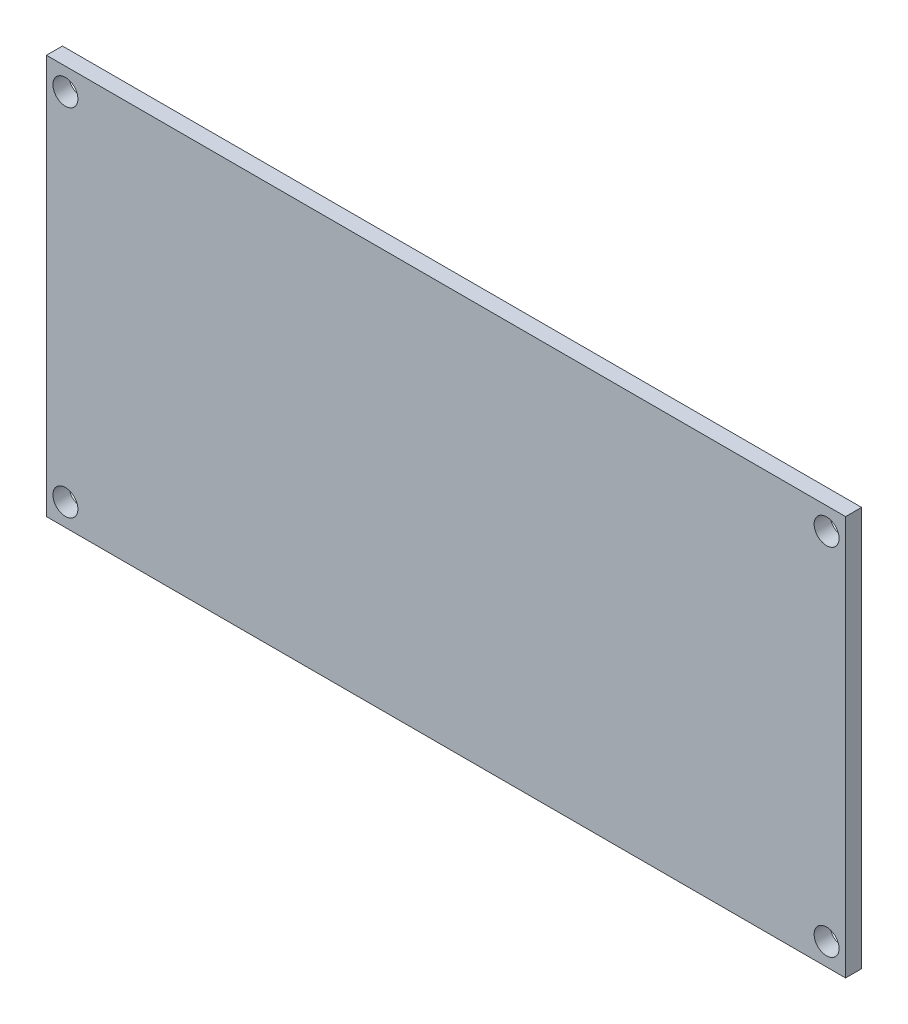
from build123d import *

# Parameters (mm, degrees)
ESQUISSE1_W        = 80
ESQUISSE1_H        = 40
ESQUISSE1_R        = 1.25
BOSS_EXTRU_1_DEPTH = 1.6


with BuildPart() as part:
    # Esquisse1 → Boss.-Extru.1 (new body)
    with BuildSketch(Plane.XY):
        Rectangle(ESQUISSE1_W, ESQUISSE1_H)
        with Locations((-38.1, 17.78)):
            Circle(ESQUISSE1_R, mode=Mode.SUBTRACT)
        with Locations(Location((-38.1, -17.78, 0), (0, 0, 180))):
            Circle(ESQUISSE1_R, mode=Mode.SUBTRACT)
        with Locations((38.1, -17.78)):
            Circle(ESQUISSE1_R, mode=Mode.SUBTRACT)
        with Locations(Location((38.1, 17.78, 0), (0, 0, 180))):
            Circle(ESQUISSE1_R, mode=Mode.SUBTRACT)
    extrude(amount=BOSS_EXTRU_1_DEPTH)


solid = part.part
